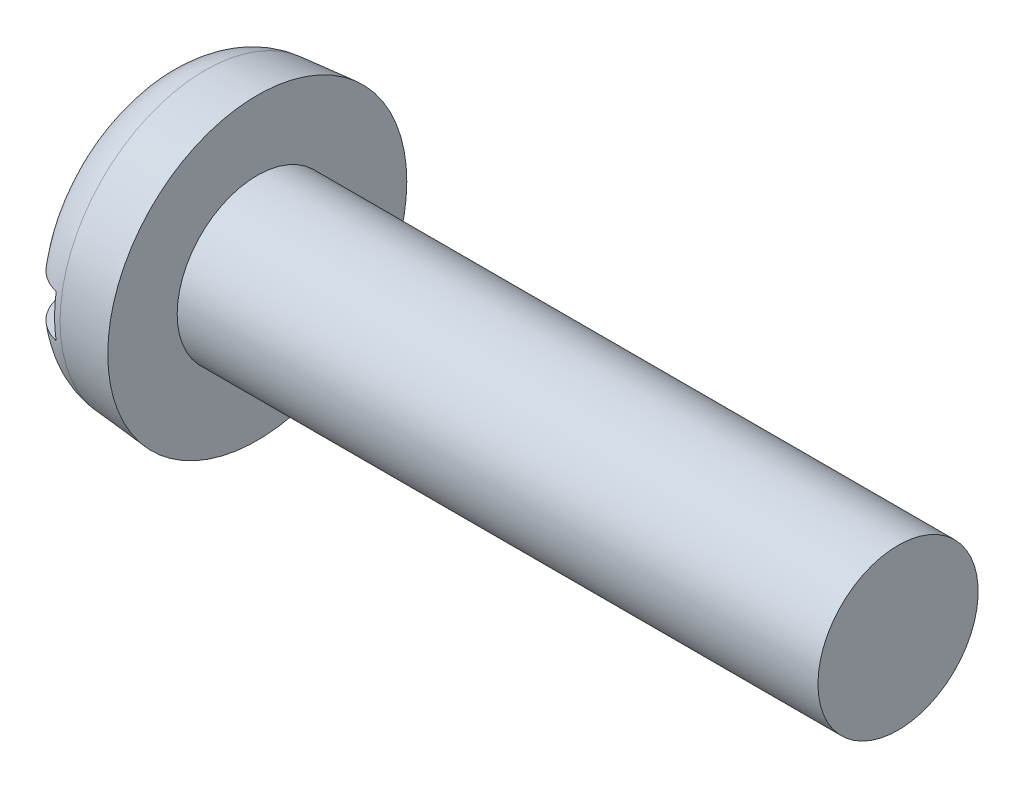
from build123d import *

# Parameters (mm, degrees)
FILLET2_R  = 0.9
SKETCH2_W  = 5.6
SKETCH2_H  = 0.8
SLOT_DEPTH = 0.7


with BuildPart() as part:
    # BodySke → Base-Revolve (revolve)
    with BuildSketch(Plane.XY, mode=Mode.PRIVATE) as base_revolve_sk:
        Polygon((1.8, 1.5), (1.8, 2.8), (0, 2.642520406), (0, 0), (13.8, 0), (13.8, 1.5), align=None)
    revolve(base_revolve_sk.sketch.rotate(Axis((-25.4, 0, 0), (1, 0, 0)), 90), axis=Axis((-25.4, 0, 0), (1, 0, 0)))

    # Fillet2
    fillet2_edges = [part.edges().sort_by_distance(p)[0] for p in [
        (0, 0, -2.642520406),
    ]]
    fillet(fillet2_edges, radius=FILLET2_R)

    # Sketch2 → Slot (cut)
    with BuildSketch(Plane(origin=(0, 0, 0), x_dir=(0, 0, -1), z_dir=(1, 0, 0))):
        Rectangle(SKETCH2_W, SKETCH2_H)
    extrude(amount=SLOT_DEPTH, mode=Mode.SUBTRACT)


solid = part.part
